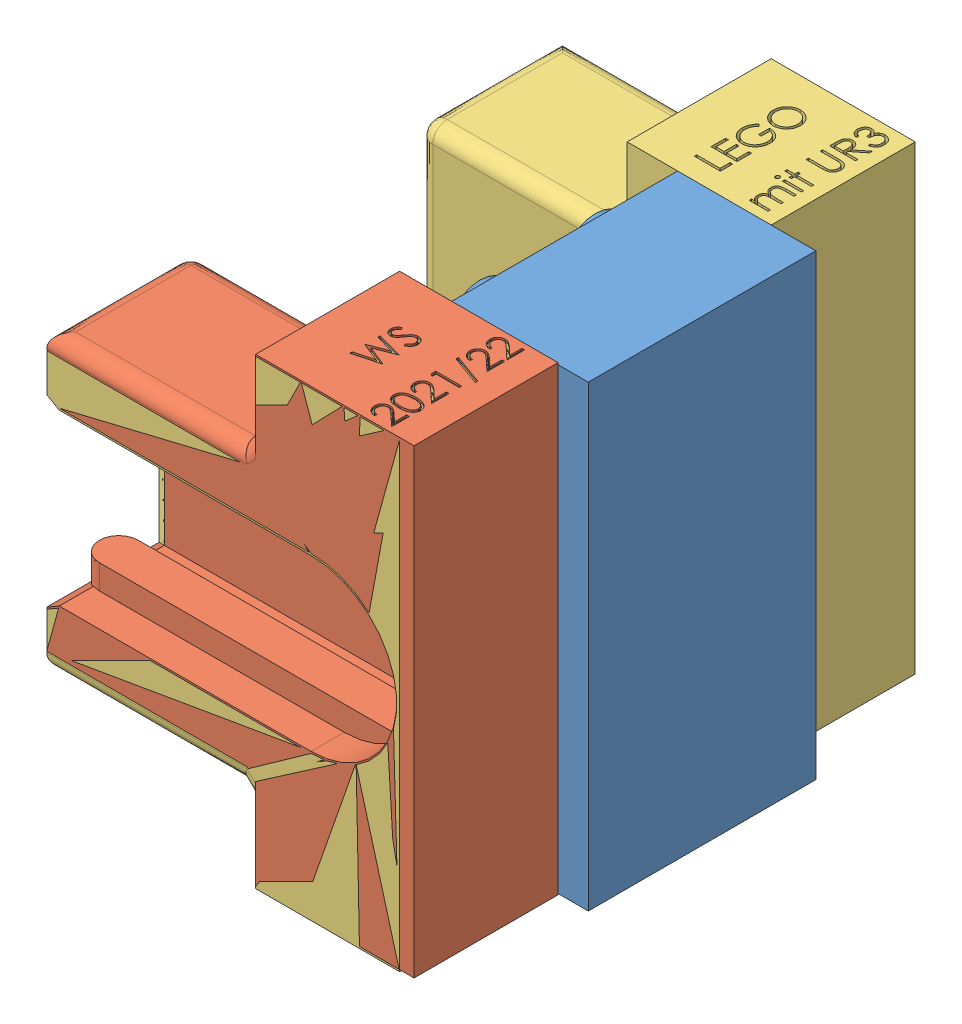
SolidWorks assembly GreiferMitLegostein.SLDASM, configuration Standard (file format 14000). Lengths in mm.
Overall size (27.6 32 35.8).
5 component instances, 3 part files, 11 mates.
Components (placement in the parent):
- Legostein-1: Legostein.SLDPRT [Standard] at (41.3912 -5.9152 7.6084) x (0 1 0) z (0 0 1) size (31.8 11.4 15.8)
- Greifbacken-2: Greifbacken.SLDPRT [Standard] at (13.7912 20.1083 33.4084) x (1 0 0) z (0 0 -1) size (25.5 32 13.51) (hidden)
- Greifbacken-3: Greifbacken.SLDPRT [Standard] at (13.7912 -0.0917 -2.3916) size (25.5 32 13.51) (hidden)
- Greifbacken_HSHL-1: Greifbacken_HSHL.SLDPRT [Standard] at (13.7912 -0.2152 -2.3916) size (24.5 32 13.51)
- Greifbacken_HSHL-2: Greifbacken_HSHL.SLDPRT [Standard] at (13.7912 19.9848 33.4084) x (1 0 0) z (0 0 -1) size (24.5 32 13.51)
Mates (geometry in assembly coordinates):
- Deckungsgleich5: coincident anti-aligned: plane of Legostein-1 through (31.7912 -5.9152 23.4084) normal (-1 0 0); plane of Greifbacken-2 through (31.7912 20.1083 33.4084) normal (1 0 0)
- Deckungsgleich6: coincident anti-aligned: plane of Legostein-1 through (41.3912 -5.9152 23.4084) normal (0 0 1); plane of Greifbacken-2 through (13.7912 20.1083 23.4084) normal (0 0 -1)
- Deckungsgleich7: coincident anti-aligned: plane of Legostein-1 through (31.7912 -5.9152 23.4084) normal (-1 0 0); plane of Greifbacken-3 through (31.7912 -0.0917 -2.3916) normal (1 0 0)
- Deckungsgleich9: coincident aligned: plane of Greifbacken-2 through (28.2912 -5.9917 67.2463) normal (0 -1 0); plane of Greifbacken-3 through (28.2912 -5.9917 -36.2294) normal (0 -1 0)
- Deckungsgleich10: coincident anti-aligned: plane of Legostein-1 through (41.3912 -5.9152 7.6084) normal (0 0 -1); plane of Greifbacken-3 through (13.7912 -0.0917 7.6084) normal (0 0 1)
- Deckungsgleich11: coincident anti-aligned: plane of Legostein-1 through (31.7912 -5.9152 23.4084) normal (-1 0 0); plane of Greifbacken_HSHL-1 through (31.7912 -0.2152 -2.3916) normal (1 0 0)
- Deckungsgleich12: coincident anti-aligned: plane of Legostein-1 through (41.3912 -5.9152 7.6084) normal (0 0 -1); plane of Greifbacken_HSHL-1 through (13.7912 -0.2152 7.6084) normal (0 0 1)
- Deckungsgleich13: coincident aligned: plane of Legostein-1 through (41.3912 25.8848 23.4084) normal (0 1 0); plane of Greifbacken_HSHL-1 through (28.2912 25.8848 -35.9177) normal (0 1 0)
- Deckungsgleich14: coincident anti-aligned: plane of Legostein-1 through (31.7912 -5.9152 23.4084) normal (-1 0 0); plane of Greifbacken_HSHL-2 through (31.7912 19.9848 33.4084) normal (1 0 0)
- Deckungsgleich15: coincident anti-aligned: plane of Legostein-1 through (41.3912 -5.9152 23.4084) normal (0 0 1); plane of Greifbacken_HSHL-2 through (13.7912 19.9848 23.4084) normal (0 0 -1)
- Deckungsgleich16: coincident aligned: plane of Legostein-1 through (41.3912 25.8848 23.4084) normal (0 1 0); plane of Greifbacken_HSHL-2 through (28.2912 25.8848 66.9346) normal (0 1 0)
